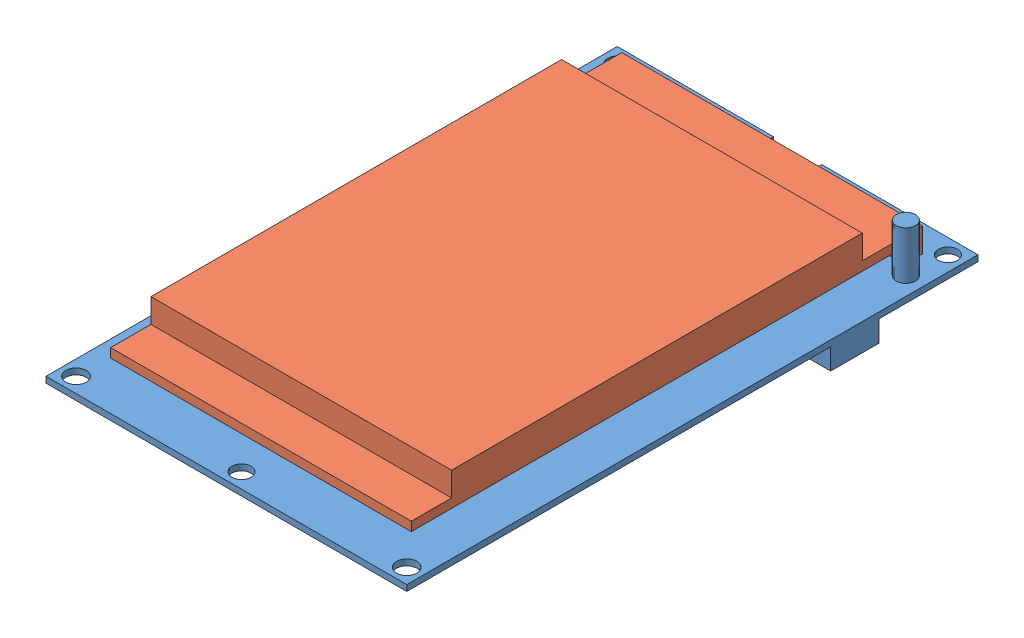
SolidWorks assembly PCB Assembly.SLDASM, configuration Default (file format 11000). Lengths in mm.
Overall size (60 12.5 95).
2 component instances, 2 part files, 3 mates.
Components (placement in the parent):
- PCB-1: PCB.SLDPRT [Default] at (-18.111 0.4886 7.3567) size (60 12.5 95)
- Display-1: Display.SLDPRT [Default] at (-17.861 1.4886 6.8567) size (50 8 85)
Mates (geometry in assembly coordinates):
- Coincident1: coincident: plane of PCB-1 through (-18.111 1.4886 7.3567) normal (0 1 0); plane of Display-1 through (-17.861 1.4886 6.8567) normal (0 -1 0)
- Distance1: distance = 4.5 mm: plane of Display-1 through (-42.861 9.4886 -35.6433) normal (0 0 -1); plane of PCB-1 through (-48.111 1.4886 -40.1433) normal (0 0 -1)
- Distance2: distance = 5.25 mm: plane of Display-1 through (-42.861 9.4886 49.3567) normal (-1 0 0); plane of PCB-1 through (-48.111 1.4886 54.8567) normal (-1 0 0)
